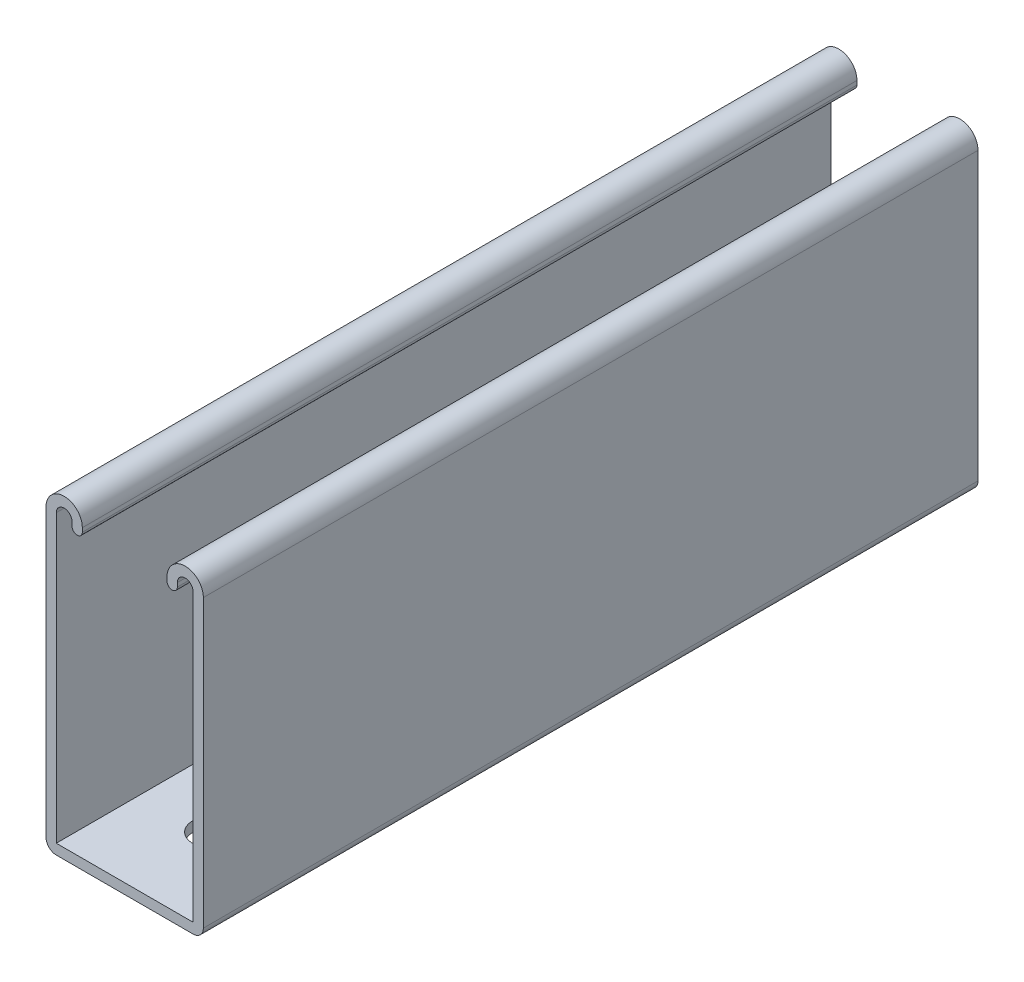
ISO-10303-21;
HEADER;
FILE_DESCRIPTION(('STEP AP214'),'2;1');
FILE_NAME('part.step','',(''),(''),'','','');
FILE_SCHEMA(('AUTOMOTIVE_DESIGN { 1 0 10303 214 1 1 1 1 }'));
ENDSEC;
DATA;
#1=APPLICATION_CONTEXT('core data for automotive mechanical design processes');
#2=APPLICATION_PROTOCOL_DEFINITION('international standard','automotive_design',2000,#1);
#3=PRODUCT_CONTEXT('',#1,'mechanical');
#4=PRODUCT('Part','Part','',(#3));
#5=PRODUCT_RELATED_PRODUCT_CATEGORY('part','',(#4));
#6=PRODUCT_DEFINITION_FORMATION('','',#4);
#7=PRODUCT_DEFINITION_CONTEXT('part definition',#1,'design');
#8=PRODUCT_DEFINITION('design','',#6,#7);
#9=PRODUCT_DEFINITION_SHAPE('','',#8);
#10=(LENGTH_UNIT() NAMED_UNIT(*) SI_UNIT(.MILLI.,.METRE.));
#11=(NAMED_UNIT(*) PLANE_ANGLE_UNIT() SI_UNIT($,.RADIAN.));
#12=(NAMED_UNIT(*) SI_UNIT($,.STERADIAN.) SOLID_ANGLE_UNIT());
#13=UNCERTAINTY_MEASURE_WITH_UNIT(LENGTH_MEASURE(1.E-05),#10,'distance_accuracy_value','');
#14=(GEOMETRIC_REPRESENTATION_CONTEXT(3) GLOBAL_UNCERTAINTY_ASSIGNED_CONTEXT((#13)) GLOBAL_UNIT_ASSIGNED_CONTEXT((#10,
#11,#12)) REPRESENTATION_CONTEXT('',''));
#15=CARTESIAN_POINT('',(0.,0.,0.));
#16=DIRECTION('',(0.,0.,1.));
#17=DIRECTION('',(1.,0.,0.));
#18=AXIS2_PLACEMENT_3D('',#15,#16,#17);
#19=CARTESIAN_POINT('',(-15.875,39.6875,203.2));
#20=DIRECTION('',(0.,0.,-1.));
#21=DIRECTION('',(-1.,0.,0.));
#22=AXIS2_PLACEMENT_3D('',#19,#20,#21);
#23=CYLINDRICAL_SURFACE('',#22,4.7625);
#24=CARTESIAN_POINT('',(-15.875,39.6875,0.));
#25=DIRECTION('',(0.,0.,1.));
#26=DIRECTION('',(-1.,0.,0.));
#27=AXIS2_PLACEMENT_3D('',#24,#25,#26);
#28=CIRCLE('',#27,4.7625);
#29=CARTESIAN_POINT('',(-11.1125,39.6875,0.));
#30=VERTEX_POINT('',#29);
#31=CARTESIAN_POINT('',(-20.6375,39.6875,0.));
#32=VERTEX_POINT('',#31);
#33=EDGE_CURVE('E260',#30,#32,#28,.T.);
#34=ORIENTED_EDGE('',*,*,#33,.T.);
#35=DIRECTION('',(0.,0.,-1.));
#36=VECTOR('',#35,1.);
#37=CARTESIAN_POINT('',(-20.6375,39.6875,203.2));
#38=LINE('',#37,#36);
#39=CARTESIAN_POINT('',(-20.6375,39.6875,203.2));
#40=VERTEX_POINT('',#39);
#41=EDGE_CURVE('E391',#40,#32,#38,.T.);
#42=ORIENTED_EDGE('',*,*,#41,.F.);
#43=CARTESIAN_POINT('',(-15.875,39.6875,203.2));
#44=DIRECTION('',(0.,0.,1.));
#45=DIRECTION('',(-1.,0.,0.));
#46=AXIS2_PLACEMENT_3D('',#43,#44,#45);
#47=CIRCLE('',#46,4.7625);
#48=CARTESIAN_POINT('',(-11.1125,39.6875,203.2));
#49=VERTEX_POINT('',#48);
#50=EDGE_CURVE('E267',#49,#40,#47,.T.);
#51=ORIENTED_EDGE('',*,*,#50,.F.);
#52=DIRECTION('',(0.,0.,-1.));
#53=VECTOR('',#52,1.);
#54=CARTESIAN_POINT('',(-11.1125,39.6875,203.2));
#55=LINE('',#54,#53);
#56=EDGE_CURVE('E305',#49,#30,#55,.T.);
#57=ORIENTED_EDGE('',*,*,#56,.T.);
#58=EDGE_LOOP('',(#34,#42,#51,#57));
#59=FACE_BOUND('',#58,.T.);
#60=ADVANCED_FACE('F39',(#59),#23,.T.);
#61=CARTESIAN_POINT('',(-20.6375,39.6875,203.2));
#62=DIRECTION('',(1.,0.,0.));
#63=DIRECTION('',(0.,1.,0.));
#64=AXIS2_PLACEMENT_3D('',#61,#62,#63);
#65=PLANE('',#64);
#66=DIRECTION('',(0.,-1.,0.));
#67=VECTOR('',#66,1.);
#68=CARTESIAN_POINT('',(-20.6375,39.6875,0.));
#69=LINE('',#68,#67);
#70=CARTESIAN_POINT('',(-20.6375,-35.4076,0.));
#71=VERTEX_POINT('',#70);
#72=EDGE_CURVE('E308',#32,#71,#69,.T.);
#73=ORIENTED_EDGE('',*,*,#72,.T.);
#74=DIRECTION('',(0.,0.,-1.));
#75=VECTOR('',#74,1.);
#76=CARTESIAN_POINT('',(-20.6375,-35.4076,203.2));
#77=LINE('',#76,#75);
#78=CARTESIAN_POINT('',(-20.6375,-35.4076,203.2));
#79=VERTEX_POINT('',#78);
#80=EDGE_CURVE('E388',#79,#71,#77,.T.);
#81=ORIENTED_EDGE('',*,*,#80,.F.);
#82=DIRECTION('',(0.,-1.,0.));
#83=VECTOR('',#82,1.);
#84=CARTESIAN_POINT('',(-20.6375,39.6875,203.2));
#85=LINE('',#84,#83);
#86=EDGE_CURVE('E270',#40,#79,#85,.T.);
#87=ORIENTED_EDGE('',*,*,#86,.F.);
#88=ORIENTED_EDGE('',*,*,#41,.T.);
#89=EDGE_LOOP('',(#73,#81,#87,#88));
#90=FACE_BOUND('',#89,.T.);
#91=ADVANCED_FACE('F433',(#90),#65,.F.);
#92=CARTESIAN_POINT('',(-17.9451,-35.4076,203.2));
#93=DIRECTION('',(0.,0.,-1.));
#94=DIRECTION('',(-1.,0.,0.));
#95=AXIS2_PLACEMENT_3D('',#92,#93,#94);
#96=CYLINDRICAL_SURFACE('',#95,2.6924);
#97=CARTESIAN_POINT('',(-17.9451,-35.4076,0.));
#98=DIRECTION('',(0.,0.,1.));
#99=DIRECTION('',(-1.,0.,0.));
#100=AXIS2_PLACEMENT_3D('',#97,#98,#99);
#101=CIRCLE('',#100,2.6924);
#102=CARTESIAN_POINT('',(-17.9451,-38.1,0.));
#103=VERTEX_POINT('',#102);
#104=EDGE_CURVE('E310',#71,#103,#101,.T.);
#105=ORIENTED_EDGE('',*,*,#104,.T.);
#106=DIRECTION('',(0.,0.,-1.));
#107=VECTOR('',#106,1.);
#108=CARTESIAN_POINT('',(-17.9451,-38.1,203.2));
#109=LINE('',#108,#107);
#110=CARTESIAN_POINT('',(-17.9451,-38.1,203.2));
#111=VERTEX_POINT('',#110);
#112=EDGE_CURVE('E385',#111,#103,#109,.T.);
#113=ORIENTED_EDGE('',*,*,#112,.F.);
#114=CARTESIAN_POINT('',(-17.9451,-35.4076,203.2));
#115=DIRECTION('',(0.,0.,1.));
#116=DIRECTION('',(-1.,0.,0.));
#117=AXIS2_PLACEMENT_3D('',#114,#115,#116);
#118=CIRCLE('',#117,2.6924);
#119=EDGE_CURVE('E273',#79,#111,#118,.T.);
#120=ORIENTED_EDGE('',*,*,#119,.F.);
#121=ORIENTED_EDGE('',*,*,#80,.T.);
#122=EDGE_LOOP('',(#105,#113,#120,#121));
#123=FACE_BOUND('',#122,.T.);
#124=ADVANCED_FACE('F438',(#123),#96,.T.);
#125=CARTESIAN_POINT('',(-17.9451,-38.1,203.2));
#126=DIRECTION('',(0.,1.,0.));
#127=DIRECTION('',(-1.,0.,0.));
#128=AXIS2_PLACEMENT_3D('',#125,#126,#127);
#129=PLANE('',#128);
#130=DIRECTION('',(0.,0.,-1.));
#131=VECTOR('',#130,1.);
#132=CARTESIAN_POINT('',(-5.15937500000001,-38.0999999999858,114.3));
#133=LINE('',#132,#131);
#134=CARTESIAN_POINT('',(-5.15937500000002,-38.1,180.18125));
#135=VERTEX_POINT('',#134);
#136=CARTESIAN_POINT('',(-5.15937500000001,-38.0999999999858,114.3));
#137=VERTEX_POINT('',#136);
#138=EDGE_CURVE('E213',#135,#137,#133,.T.);
#139=ORIENTED_EDGE('',*,*,#138,.F.);
#140=CARTESIAN_POINT('',(0.,-38.0999999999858,180.18125));
#141=DIRECTION('',(0.,-1.,0.));
#142=DIRECTION('',(1.,0.,0.));
#143=AXIS2_PLACEMENT_3D('',#140,#141,#142);
#144=CIRCLE('',#143,5.159375);
#145=CARTESIAN_POINT('',(5.15937499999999,-38.0999999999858,180.18125));
#146=VERTEX_POINT('',#145);
#147=EDGE_CURVE('E53',#146,#135,#144,.T.);
#148=ORIENTED_EDGE('',*,*,#147,.F.);
#149=DIRECTION('',(0.,0.,1.));
#150=VECTOR('',#149,1.);
#151=CARTESIAN_POINT('',(5.15937499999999,-38.0999999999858,180.18125));
#152=LINE('',#151,#150);
#153=CARTESIAN_POINT('',(5.159375,-38.0999999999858,114.3));
#154=VERTEX_POINT('',#153);
#155=EDGE_CURVE('E229',#154,#146,#152,.T.);
#156=ORIENTED_EDGE('',*,*,#155,.F.);
#157=CARTESIAN_POINT('',(0.,-38.0999999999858,114.3));
#158=DIRECTION('',(0.,-1.,0.));
#159=DIRECTION('',(1.,0.,0.));
#160=AXIS2_PLACEMENT_3D('',#157,#158,#159);
#161=CIRCLE('',#160,5.159375);
#162=EDGE_CURVE('E223',#137,#154,#161,.T.);
#163=ORIENTED_EDGE('',*,*,#162,.F.);
#164=EDGE_LOOP('',(#139,#148,#156,#163));
#165=FACE_BOUND('',#164,.T.);
#166=DIRECTION('',(0.,0.,-1.));
#167=VECTOR('',#166,1.);
#168=CARTESIAN_POINT('',(-5.15937500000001,-38.0999999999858,12.7));
#169=LINE('',#168,#167);
#170=CARTESIAN_POINT('',(-5.15937500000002,-38.1,78.58125));
#171=VERTEX_POINT('',#170);
#172=CARTESIAN_POINT('',(-5.15937500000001,-38.0999999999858,12.7));
#173=VERTEX_POINT('',#172);
#174=EDGE_CURVE('E248',#171,#173,#169,.T.);
#175=ORIENTED_EDGE('',*,*,#174,.F.);
#176=CARTESIAN_POINT('',(0.,-38.0999999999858,78.58125));
#177=DIRECTION('',(0.,-1.,0.));
#178=DIRECTION('',(1.,0.,0.));
#179=AXIS2_PLACEMENT_3D('',#176,#177,#178);
#180=CIRCLE('',#179,5.159375);
#181=CARTESIAN_POINT('',(5.15937499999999,-38.0999999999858,78.58125));
#182=VERTEX_POINT('',#181);
#183=EDGE_CURVE('E246',#182,#171,#180,.T.);
#184=ORIENTED_EDGE('',*,*,#183,.F.);
#185=DIRECTION('',(0.,0.,1.));
#186=VECTOR('',#185,1.);
#187=CARTESIAN_POINT('',(5.15937499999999,-38.0999999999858,78.58125));
#188=LINE('',#187,#186);
#189=CARTESIAN_POINT('',(5.159375,-38.0999999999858,12.7));
#190=VERTEX_POINT('',#189);
#191=EDGE_CURVE('E254',#190,#182,#188,.T.);
#192=ORIENTED_EDGE('',*,*,#191,.F.);
#193=CARTESIAN_POINT('',(0.,-38.0999999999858,12.7));
#194=DIRECTION('',(0.,-1.,0.));
#195=DIRECTION('',(1.,0.,0.));
#196=AXIS2_PLACEMENT_3D('',#193,#194,#195);
#197=CIRCLE('',#196,5.159375);
#198=EDGE_CURVE('E251',#173,#190,#197,.T.);
#199=ORIENTED_EDGE('',*,*,#198,.F.);
#200=EDGE_LOOP('',(#175,#184,#192,#199));
#201=FACE_BOUND('',#200,.T.);
#202=DIRECTION('',(1.,0.,0.));
#203=VECTOR('',#202,1.);
#204=CARTESIAN_POINT('',(-17.9451,-38.1,0.));
#205=LINE('',#204,#203);
#206=CARTESIAN_POINT('',(17.9451,-38.1,0.));
#207=VERTEX_POINT('',#206);
#208=EDGE_CURVE('E312',#103,#207,#205,.T.);
#209=ORIENTED_EDGE('',*,*,#208,.T.);
#210=DIRECTION('',(0.,0.,-1.));
#211=VECTOR('',#210,1.);
#212=CARTESIAN_POINT('',(17.9451,-38.1,203.2));
#213=LINE('',#212,#211);
#214=CARTESIAN_POINT('',(17.9451,-38.1,203.2));
#215=VERTEX_POINT('',#214);
#216=EDGE_CURVE('E382',#215,#207,#213,.T.);
#217=ORIENTED_EDGE('',*,*,#216,.F.);
#218=DIRECTION('',(1.,0.,0.));
#219=VECTOR('',#218,1.);
#220=CARTESIAN_POINT('',(-17.9451,-38.1,203.2));
#221=LINE('',#220,#219);
#222=EDGE_CURVE('E275',#111,#215,#221,.T.);
#223=ORIENTED_EDGE('',*,*,#222,.F.);
#224=ORIENTED_EDGE('',*,*,#112,.T.);
#225=EDGE_LOOP('',(#209,#217,#223,#224));
#226=FACE_BOUND('',#225,.T.);
#227=ADVANCED_FACE('F227',(#165,#201,#226),#129,.F.);
#228=CARTESIAN_POINT('',(17.9451,-35.4076,203.2));
#229=DIRECTION('',(0.,0.,-1.));
#230=DIRECTION('',(-1.,0.,0.));
#231=AXIS2_PLACEMENT_3D('',#228,#229,#230);
#232=CYLINDRICAL_SURFACE('',#231,2.6924);
#233=CARTESIAN_POINT('',(17.9451,-35.4076,0.));
#234=DIRECTION('',(0.,0.,1.));
#235=DIRECTION('',(1.,0.,0.));
#236=AXIS2_PLACEMENT_3D('',#233,#234,#235);
#237=CIRCLE('',#236,2.6924);
#238=CARTESIAN_POINT('',(20.6375,-35.4076,0.));
#239=VERTEX_POINT('',#238);
#240=EDGE_CURVE('E314',#207,#239,#237,.T.);
#241=ORIENTED_EDGE('',*,*,#240,.T.);
#242=DIRECTION('',(0.,0.,-1.));
#243=VECTOR('',#242,1.);
#244=CARTESIAN_POINT('',(20.6375,-35.4076,203.2));
#245=LINE('',#244,#243);
#246=CARTESIAN_POINT('',(20.6375,-35.4076,203.2));
#247=VERTEX_POINT('',#246);
#248=EDGE_CURVE('E379',#247,#239,#245,.T.);
#249=ORIENTED_EDGE('',*,*,#248,.F.);
#250=CARTESIAN_POINT('',(17.9451,-35.4076,203.2));
#251=DIRECTION('',(0.,0.,1.));
#252=DIRECTION('',(1.,0.,0.));
#253=AXIS2_PLACEMENT_3D('',#250,#251,#252);
#254=CIRCLE('',#253,2.6924);
#255=EDGE_CURVE('E277',#215,#247,#254,.T.);
#256=ORIENTED_EDGE('',*,*,#255,.F.);
#257=ORIENTED_EDGE('',*,*,#216,.T.);
#258=EDGE_LOOP('',(#241,#249,#256,#257));
#259=FACE_BOUND('',#258,.T.);
#260=ADVANCED_FACE('F518',(#259),#232,.T.);
#261=CARTESIAN_POINT('',(20.6375,-35.4076,203.2));
#262=DIRECTION('',(-1.,0.,0.));
#263=DIRECTION('',(0.,-1.,0.));
#264=AXIS2_PLACEMENT_3D('',#261,#262,#263);
#265=PLANE('',#264);
#266=DIRECTION('',(0.,1.,0.));
#267=VECTOR('',#266,1.);
#268=CARTESIAN_POINT('',(20.6375,-35.4076,0.));
#269=LINE('',#268,#267);
#270=CARTESIAN_POINT('',(20.6375,39.6875,0.));
#271=VERTEX_POINT('',#270);
#272=EDGE_CURVE('E316',#239,#271,#269,.T.);
#273=ORIENTED_EDGE('',*,*,#272,.T.);
#274=DIRECTION('',(0.,0.,-1.));
#275=VECTOR('',#274,1.);
#276=CARTESIAN_POINT('',(20.6375,39.6875,203.2));
#277=LINE('',#276,#275);
#278=CARTESIAN_POINT('',(20.6375,39.6875,203.2));
#279=VERTEX_POINT('',#278);
#280=EDGE_CURVE('E376',#279,#271,#277,.T.);
#281=ORIENTED_EDGE('',*,*,#280,.F.);
#282=DIRECTION('',(0.,1.,0.));
#283=VECTOR('',#282,1.);
#284=CARTESIAN_POINT('',(20.6375,-35.4076,203.2));
#285=LINE('',#284,#283);
#286=EDGE_CURVE('E279',#247,#279,#285,.T.);
#287=ORIENTED_EDGE('',*,*,#286,.F.);
#288=ORIENTED_EDGE('',*,*,#248,.T.);
#289=EDGE_LOOP('',(#273,#281,#287,#288));
#290=FACE_BOUND('',#289,.T.);
#291=ADVANCED_FACE('F514',(#290),#265,.F.);
#292=CARTESIAN_POINT('',(15.875,39.6875,203.2));
#293=DIRECTION('',(0.,0.,-1.));
#294=DIRECTION('',(-1.,0.,0.));
#295=AXIS2_PLACEMENT_3D('',#292,#293,#294);
#296=CYLINDRICAL_SURFACE('',#295,4.7625);
#297=CARTESIAN_POINT('',(15.875,39.6875,0.));
#298=DIRECTION('',(0.,0.,1.));
#299=DIRECTION('',(1.,0.,0.));
#300=AXIS2_PLACEMENT_3D('',#297,#298,#299);
#301=CIRCLE('',#300,4.7625);
#302=CARTESIAN_POINT('',(11.1125,39.6875,0.));
#303=VERTEX_POINT('',#302);
#304=EDGE_CURVE('E318',#271,#303,#301,.T.);
#305=ORIENTED_EDGE('',*,*,#304,.T.);
#306=DIRECTION('',(0.,0.,-1.));
#307=VECTOR('',#306,1.);
#308=CARTESIAN_POINT('',(11.1125,39.6875,203.2));
#309=LINE('',#308,#307);
#310=CARTESIAN_POINT('',(11.1125,39.6875,203.2));
#311=VERTEX_POINT('',#310);
#312=EDGE_CURVE('E373',#311,#303,#309,.T.);
#313=ORIENTED_EDGE('',*,*,#312,.F.);
#314=CARTESIAN_POINT('',(15.875,39.6875,203.2));
#315=DIRECTION('',(0.,0.,1.));
#316=DIRECTION('',(1.,0.,0.));
#317=AXIS2_PLACEMENT_3D('',#314,#315,#316);
#318=CIRCLE('',#317,4.7625);
#319=EDGE_CURVE('E281',#279,#311,#318,.T.);
#320=ORIENTED_EDGE('',*,*,#319,.F.);
#321=ORIENTED_EDGE('',*,*,#280,.T.);
#322=EDGE_LOOP('',(#305,#313,#320,#321));
#323=FACE_BOUND('',#322,.T.);
#324=ADVANCED_FACE('F509',(#323),#296,.T.);
#325=CARTESIAN_POINT('',(11.1125,39.6875,203.2));
#326=DIRECTION('',(1.,0.,0.));
#327=DIRECTION('',(0.,1.,0.));
#328=AXIS2_PLACEMENT_3D('',#325,#326,#327);
#329=PLANE('',#328);
#330=DIRECTION('',(0.,-1.,0.));
#331=VECTOR('',#330,1.);
#332=CARTESIAN_POINT('',(11.1125,39.6875,0.));
#333=LINE('',#332,#331);
#334=CARTESIAN_POINT('',(11.1125,38.65245,0.));
#335=VERTEX_POINT('',#334);
#336=EDGE_CURVE('E320',#303,#335,#333,.T.);
#337=ORIENTED_EDGE('',*,*,#336,.T.);
#338=DIRECTION('',(0.,0.,-1.));
#339=VECTOR('',#338,1.);
#340=CARTESIAN_POINT('',(11.1125,38.65245,203.2));
#341=LINE('',#340,#339);
#342=CARTESIAN_POINT('',(11.1125,38.65245,203.2));
#343=VERTEX_POINT('',#342);
#344=EDGE_CURVE('E370',#343,#335,#341,.T.);
#345=ORIENTED_EDGE('',*,*,#344,.F.);
#346=DIRECTION('',(0.,-1.,0.));
#347=VECTOR('',#346,1.);
#348=CARTESIAN_POINT('',(11.1125,39.6875,203.2));
#349=LINE('',#348,#347);
#350=EDGE_CURVE('E283',#311,#343,#349,.T.);
#351=ORIENTED_EDGE('',*,*,#350,.F.);
#352=ORIENTED_EDGE('',*,*,#312,.T.);
#353=EDGE_LOOP('',(#337,#345,#351,#352));
#354=FACE_BOUND('',#353,.T.);
#355=ADVANCED_FACE('F503',(#354),#329,.F.);
#356=CARTESIAN_POINT('',(12.4587,38.65245,203.2));
#357=DIRECTION('',(0.,0.,-1.));
#358=DIRECTION('',(-1.,0.,0.));
#359=AXIS2_PLACEMENT_3D('',#356,#357,#358);
#360=CYLINDRICAL_SURFACE('',#359,1.3462);
#361=CARTESIAN_POINT('',(12.4587,38.65245,0.));
#362=DIRECTION('',(0.,0.,1.));
#363=DIRECTION('',(1.,0.,0.));
#364=AXIS2_PLACEMENT_3D('',#361,#362,#363);
#365=CIRCLE('',#364,1.3462);
#366=CARTESIAN_POINT('',(13.8049,38.65245,0.));
#367=VERTEX_POINT('',#366);
#368=EDGE_CURVE('E322',#335,#367,#365,.T.);
#369=ORIENTED_EDGE('',*,*,#368,.T.);
#370=DIRECTION('',(0.,0.,-1.));
#371=VECTOR('',#370,1.);
#372=CARTESIAN_POINT('',(13.8049,38.65245,203.2));
#373=LINE('',#372,#371);
#374=CARTESIAN_POINT('',(13.8049,38.65245,203.2));
#375=VERTEX_POINT('',#374);
#376=EDGE_CURVE('E367',#375,#367,#373,.T.);
#377=ORIENTED_EDGE('',*,*,#376,.F.);
#378=CARTESIAN_POINT('',(12.4587,38.65245,203.2));
#379=DIRECTION('',(0.,0.,1.));
#380=DIRECTION('',(1.,0.,0.));
#381=AXIS2_PLACEMENT_3D('',#378,#379,#380);
#382=CIRCLE('',#381,1.3462);
#383=EDGE_CURVE('E285',#343,#375,#382,.T.);
#384=ORIENTED_EDGE('',*,*,#383,.F.);
#385=ORIENTED_EDGE('',*,*,#344,.T.);
#386=EDGE_LOOP('',(#369,#377,#384,#385));
#387=FACE_BOUND('',#386,.T.);
#388=ADVANCED_FACE('F499',(#387),#360,.T.);
#389=CARTESIAN_POINT('',(13.8049,39.6875,203.2));
#390=DIRECTION('',(-1.,0.,0.));
#391=DIRECTION('',(0.,0.,1.));
#392=AXIS2_PLACEMENT_3D('',#389,#390,#391);
#393=PLANE('',#392);
#394=DIRECTION('',(0.,1.,0.));
#395=VECTOR('',#394,1.);
#396=CARTESIAN_POINT('',(13.8049,39.6875,0.));
#397=LINE('',#396,#395);
#398=CARTESIAN_POINT('',(13.8049,39.6875,0.));
#399=VERTEX_POINT('',#398);
#400=EDGE_CURVE('E324',#367,#399,#397,.T.);
#401=ORIENTED_EDGE('',*,*,#400,.T.);
#402=DIRECTION('',(0.,0.,-1.));
#403=VECTOR('',#402,1.);
#404=CARTESIAN_POINT('',(13.8049,39.6875,203.2));
#405=LINE('',#404,#403);
#406=CARTESIAN_POINT('',(13.8049,39.6875,203.2));
#407=VERTEX_POINT('',#406);
#408=EDGE_CURVE('E364',#407,#399,#405,.T.);
#409=ORIENTED_EDGE('',*,*,#408,.F.);
#410=DIRECTION('',(0.,1.,0.));
#411=VECTOR('',#410,1.);
#412=CARTESIAN_POINT('',(13.8049,39.6875,203.2));
#413=LINE('',#412,#411);
#414=EDGE_CURVE('E287',#375,#407,#413,.T.);
#415=ORIENTED_EDGE('',*,*,#414,.F.);
#416=ORIENTED_EDGE('',*,*,#376,.T.);
#417=EDGE_LOOP('',(#401,#409,#415,#416));
#418=FACE_BOUND('',#417,.T.);
#419=ADVANCED_FACE('F494',(#418),#393,.F.);
#420=CARTESIAN_POINT('',(15.875,39.6875,203.2));
#421=DIRECTION('',(0.,0.,-1.));
#422=DIRECTION('',(-1.,0.,0.));
#423=AXIS2_PLACEMENT_3D('',#420,#421,#422);
#424=CYLINDRICAL_SURFACE('',#423,2.07010000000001);
#425=CARTESIAN_POINT('',(15.875,39.6875,0.));
#426=DIRECTION('',(0.,0.,-1.));
#427=DIRECTION('',(1.,0.,0.));
#428=AXIS2_PLACEMENT_3D('',#425,#426,#427);
#429=CIRCLE('',#428,2.07010000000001);
#430=CARTESIAN_POINT('',(17.9451,39.6875,0.));
#431=VERTEX_POINT('',#430);
#432=EDGE_CURVE('E326',#399,#431,#429,.T.);
#433=ORIENTED_EDGE('',*,*,#432,.T.);
#434=DIRECTION('',(0.,0.,-1.));
#435=VECTOR('',#434,1.);
#436=CARTESIAN_POINT('',(17.9451,39.6875,203.2));
#437=LINE('',#436,#435);
#438=CARTESIAN_POINT('',(17.9451,39.6875,203.2));
#439=VERTEX_POINT('',#438);
#440=EDGE_CURVE('E361',#439,#431,#437,.T.);
#441=ORIENTED_EDGE('',*,*,#440,.F.);
#442=CARTESIAN_POINT('',(15.875,39.6875,203.2));
#443=DIRECTION('',(0.,0.,-1.));
#444=DIRECTION('',(1.,0.,0.));
#445=AXIS2_PLACEMENT_3D('',#442,#443,#444);
#446=CIRCLE('',#445,2.07010000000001);
#447=EDGE_CURVE('E289',#407,#439,#446,.T.);
#448=ORIENTED_EDGE('',*,*,#447,.F.);
#449=ORIENTED_EDGE('',*,*,#408,.T.);
#450=EDGE_LOOP('',(#433,#441,#448,#449));
#451=FACE_BOUND('',#450,.T.);
#452=ADVANCED_FACE('F488',(#451),#424,.F.);
#453=CARTESIAN_POINT('',(17.9451,-35.4076,203.2));
#454=DIRECTION('',(1.,0.,0.));
#455=DIRECTION('',(0.,0.,-1.));
#456=AXIS2_PLACEMENT_3D('',#453,#454,#455);
#457=PLANE('',#456);
#458=DIRECTION('',(0.,-1.,0.));
#459=VECTOR('',#458,1.);
#460=CARTESIAN_POINT('',(17.9451,-35.4076,0.));
#461=LINE('',#460,#459);
#462=CARTESIAN_POINT('',(17.9451,-35.4076,0.));
#463=VERTEX_POINT('',#462);
#464=EDGE_CURVE('E328',#431,#463,#461,.T.);
#465=ORIENTED_EDGE('',*,*,#464,.T.);
#466=DIRECTION('',(0.,0.,-1.));
#467=VECTOR('',#466,1.);
#468=CARTESIAN_POINT('',(17.9451,-35.4076,203.2));
#469=LINE('',#468,#467);
#470=CARTESIAN_POINT('',(17.9451,-35.4076,203.2));
#471=VERTEX_POINT('',#470);
#472=EDGE_CURVE('E358',#471,#463,#469,.T.);
#473=ORIENTED_EDGE('',*,*,#472,.F.);
#474=DIRECTION('',(0.,-1.,0.));
#475=VECTOR('',#474,1.);
#476=CARTESIAN_POINT('',(17.9451,-35.4076,203.2));
#477=LINE('',#476,#475);
#478=EDGE_CURVE('E291',#439,#471,#477,.T.);
#479=ORIENTED_EDGE('',*,*,#478,.F.);
#480=ORIENTED_EDGE('',*,*,#440,.T.);
#481=EDGE_LOOP('',(#465,#473,#479,#480));
#482=FACE_BOUND('',#481,.T.);
#483=ADVANCED_FACE('F484',(#482),#457,.F.);
#484=CARTESIAN_POINT('',(-17.9451,-35.4076,203.2));
#485=DIRECTION('',(0.,-1.,0.));
#486=DIRECTION('',(0.,0.,-1.));
#487=AXIS2_PLACEMENT_3D('',#484,#485,#486);
#488=PLANE('',#487);
#489=DIRECTION('',(0.,0.,1.));
#490=VECTOR('',#489,1.);
#491=CARTESIAN_POINT('',(5.15937499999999,-35.4076,304.8));
#492=LINE('',#491,#490);
#493=CARTESIAN_POINT('',(5.159375,-35.4076,114.3));
#494=VERTEX_POINT('',#493);
#495=CARTESIAN_POINT('',(5.15937499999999,-35.4076,180.18125));
#496=VERTEX_POINT('',#495);
#497=EDGE_CURVE('E239',#494,#496,#492,.T.);
#498=ORIENTED_EDGE('',*,*,#497,.T.);
#499=CARTESIAN_POINT('',(0.,-35.4076,180.18125));
#500=DIRECTION('',(0.,-1.,0.));
#501=DIRECTION('',(0.,0.,-1.));
#502=AXIS2_PLACEMENT_3D('',#499,#500,#501);
#503=CIRCLE('',#502,5.159375);
#504=CARTESIAN_POINT('',(-5.15937500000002,-35.4076,180.18125));
#505=VERTEX_POINT('',#504);
#506=EDGE_CURVE('E243',#496,#505,#503,.T.);
#507=ORIENTED_EDGE('',*,*,#506,.T.);
#508=DIRECTION('',(0.,0.,-1.));
#509=VECTOR('',#508,1.);
#510=CARTESIAN_POINT('',(-5.15937500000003,-35.4076,304.8));
#511=LINE('',#510,#509);
#512=CARTESIAN_POINT('',(-5.15937500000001,-35.4076,114.3));
#513=VERTEX_POINT('',#512);
#514=EDGE_CURVE('E220',#505,#513,#511,.T.);
#515=ORIENTED_EDGE('',*,*,#514,.T.);
#516=CARTESIAN_POINT('',(0.,-35.4076,114.3));
#517=DIRECTION('',(0.,-1.,0.));
#518=DIRECTION('',(0.,0.,-1.));
#519=AXIS2_PLACEMENT_3D('',#516,#517,#518);
#520=CIRCLE('',#519,5.159375);
#521=EDGE_CURVE('E61',#513,#494,#520,.T.);
#522=ORIENTED_EDGE('',*,*,#521,.T.);
#523=EDGE_LOOP('',(#498,#507,#515,#522));
#524=FACE_BOUND('',#523,.T.);
#525=DIRECTION('',(0.,0.,1.));
#526=VECTOR('',#525,1.);
#527=CARTESIAN_POINT('',(5.15937499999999,-35.4076,203.2));
#528=LINE('',#527,#526);
#529=CARTESIAN_POINT('',(5.159375,-35.4076,12.7));
#530=VERTEX_POINT('',#529);
#531=CARTESIAN_POINT('',(5.15937499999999,-35.4076,78.58125));
#532=VERTEX_POINT('',#531);
#533=EDGE_CURVE('E46',#530,#532,#528,.T.);
#534=ORIENTED_EDGE('',*,*,#533,.T.);
#535=CARTESIAN_POINT('',(0.,-35.4076,78.58125));
#536=DIRECTION('',(0.,-1.,0.));
#537=DIRECTION('',(0.,0.,-1.));
#538=AXIS2_PLACEMENT_3D('',#535,#536,#537);
#539=CIRCLE('',#538,5.159375);
#540=CARTESIAN_POINT('',(-5.15937500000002,-35.4076,78.58125));
#541=VERTEX_POINT('',#540);
#542=EDGE_CURVE('E11',#532,#541,#539,.T.);
#543=ORIENTED_EDGE('',*,*,#542,.T.);
#544=DIRECTION('',(0.,0.,-1.));
#545=VECTOR('',#544,1.);
#546=CARTESIAN_POINT('',(-5.15937500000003,-35.4076,203.2));
#547=LINE('',#546,#545);
#548=CARTESIAN_POINT('',(-5.15937500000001,-35.4076,12.7));
#549=VERTEX_POINT('',#548);
#550=EDGE_CURVE('E394',#541,#549,#547,.T.);
#551=ORIENTED_EDGE('',*,*,#550,.T.);
#552=CARTESIAN_POINT('',(0.,-35.4076,12.7));
#553=DIRECTION('',(0.,-1.,0.));
#554=DIRECTION('',(0.,0.,-1.));
#555=AXIS2_PLACEMENT_3D('',#552,#553,#554);
#556=CIRCLE('',#555,5.159375);
#557=EDGE_CURVE('E397',#549,#530,#556,.T.);
#558=ORIENTED_EDGE('',*,*,#557,.T.);
#559=EDGE_LOOP('',(#534,#543,#551,#558));
#560=FACE_BOUND('',#559,.T.);
#561=DIRECTION('',(-1.,0.,0.));
#562=VECTOR('',#561,1.);
#563=CARTESIAN_POINT('',(-17.9451,-35.4076,0.));
#564=LINE('',#563,#562);
#565=CARTESIAN_POINT('',(-17.9451,-35.4076,0.));
#566=VERTEX_POINT('',#565);
#567=EDGE_CURVE('E330',#463,#566,#564,.T.);
#568=ORIENTED_EDGE('',*,*,#567,.T.);
#569=DIRECTION('',(0.,0.,-1.));
#570=VECTOR('',#569,1.);
#571=CARTESIAN_POINT('',(-17.9451,-35.4076,203.2));
#572=LINE('',#571,#570);
#573=CARTESIAN_POINT('',(-17.9451,-35.4076,203.2));
#574=VERTEX_POINT('',#573);
#575=EDGE_CURVE('E355',#574,#566,#572,.T.);
#576=ORIENTED_EDGE('',*,*,#575,.F.);
#577=DIRECTION('',(-1.,0.,0.));
#578=VECTOR('',#577,1.);
#579=CARTESIAN_POINT('',(-17.9451,-35.4076,203.2));
#580=LINE('',#579,#578);
#581=EDGE_CURVE('E293',#471,#574,#580,.T.);
#582=ORIENTED_EDGE('',*,*,#581,.F.);
#583=ORIENTED_EDGE('',*,*,#472,.T.);
#584=EDGE_LOOP('',(#568,#576,#582,#583));
#585=FACE_BOUND('',#584,.T.);
#586=ADVANCED_FACE('F401',(#524,#560,#585),#488,.F.);
#587=CARTESIAN_POINT('',(-17.9451,39.6875,203.2));
#588=DIRECTION('',(-1.,0.,0.));
#589=DIRECTION('',(0.,-1.,0.));
#590=AXIS2_PLACEMENT_3D('',#587,#588,#589);
#591=PLANE('',#590);
#592=DIRECTION('',(0.,1.,0.));
#593=VECTOR('',#592,1.);
#594=CARTESIAN_POINT('',(-17.9451,39.6875,0.));
#595=LINE('',#594,#593);
#596=CARTESIAN_POINT('',(-17.9451,39.6875,0.));
#597=VERTEX_POINT('',#596);
#598=EDGE_CURVE('E332',#566,#597,#595,.T.);
#599=ORIENTED_EDGE('',*,*,#598,.T.);
#600=DIRECTION('',(0.,0.,-1.));
#601=VECTOR('',#600,1.);
#602=CARTESIAN_POINT('',(-17.9451,39.6875,203.2));
#603=LINE('',#602,#601);
#604=CARTESIAN_POINT('',(-17.9451,39.6875,203.2));
#605=VERTEX_POINT('',#604);
#606=EDGE_CURVE('E352',#605,#597,#603,.T.);
#607=ORIENTED_EDGE('',*,*,#606,.F.);
#608=DIRECTION('',(0.,1.,0.));
#609=VECTOR('',#608,1.);
#610=CARTESIAN_POINT('',(-17.9451,39.6875,203.2));
#611=LINE('',#610,#609);
#612=EDGE_CURVE('E295',#574,#605,#611,.T.);
#613=ORIENTED_EDGE('',*,*,#612,.F.);
#614=ORIENTED_EDGE('',*,*,#575,.T.);
#615=EDGE_LOOP('',(#599,#607,#613,#614));
#616=FACE_BOUND('',#615,.T.);
#617=ADVANCED_FACE('F475',(#616),#591,.F.);
#618=CARTESIAN_POINT('',(-15.875,39.6875,203.2));
#619=DIRECTION('',(0.,0.,-1.));
#620=DIRECTION('',(-1.,0.,0.));
#621=AXIS2_PLACEMENT_3D('',#618,#619,#620);
#622=CYLINDRICAL_SURFACE('',#621,2.0701);
#623=CARTESIAN_POINT('',(-15.875,39.6875,0.));
#624=DIRECTION('',(0.,0.,-1.));
#625=DIRECTION('',(-1.,0.,0.));
#626=AXIS2_PLACEMENT_3D('',#623,#624,#625);
#627=CIRCLE('',#626,2.0701);
#628=CARTESIAN_POINT('',(-13.8049,39.6875,0.));
#629=VERTEX_POINT('',#628);
#630=EDGE_CURVE('E334',#597,#629,#627,.T.);
#631=ORIENTED_EDGE('',*,*,#630,.T.);
#632=DIRECTION('',(0.,0.,-1.));
#633=VECTOR('',#632,1.);
#634=CARTESIAN_POINT('',(-13.8049,39.6875,203.2));
#635=LINE('',#634,#633);
#636=CARTESIAN_POINT('',(-13.8049,39.6875,203.2));
#637=VERTEX_POINT('',#636);
#638=EDGE_CURVE('E349',#637,#629,#635,.T.);
#639=ORIENTED_EDGE('',*,*,#638,.F.);
#640=CARTESIAN_POINT('',(-15.875,39.6875,203.2));
#641=DIRECTION('',(0.,0.,-1.));
#642=DIRECTION('',(-1.,0.,0.));
#643=AXIS2_PLACEMENT_3D('',#640,#641,#642);
#644=CIRCLE('',#643,2.0701);
#645=EDGE_CURVE('E297',#605,#637,#644,.T.);
#646=ORIENTED_EDGE('',*,*,#645,.F.);
#647=ORIENTED_EDGE('',*,*,#606,.T.);
#648=EDGE_LOOP('',(#631,#639,#646,#647));
#649=FACE_BOUND('',#648,.T.);
#650=ADVANCED_FACE('F471',(#649),#622,.F.);
#651=CARTESIAN_POINT('',(-13.8049,39.6875,203.2));
#652=DIRECTION('',(1.,0.,0.));
#653=DIRECTION('',(0.,1.,0.));
#654=AXIS2_PLACEMENT_3D('',#651,#652,#653);
#655=PLANE('',#654);
#656=DIRECTION('',(0.,-1.,0.));
#657=VECTOR('',#656,1.);
#658=CARTESIAN_POINT('',(-13.8049,39.6875,0.));
#659=LINE('',#658,#657);
#660=CARTESIAN_POINT('',(-13.8049,38.65245,0.));
#661=VERTEX_POINT('',#660);
#662=EDGE_CURVE('E336',#629,#661,#659,.T.);
#663=ORIENTED_EDGE('',*,*,#662,.T.);
#664=DIRECTION('',(0.,0.,-1.));
#665=VECTOR('',#664,1.);
#666=CARTESIAN_POINT('',(-13.8049,38.65245,203.2));
#667=LINE('',#666,#665);
#668=CARTESIAN_POINT('',(-13.8049,38.65245,203.2));
#669=VERTEX_POINT('',#668);
#670=EDGE_CURVE('E346',#669,#661,#667,.T.);
#671=ORIENTED_EDGE('',*,*,#670,.F.);
#672=DIRECTION('',(0.,-1.,0.));
#673=VECTOR('',#672,1.);
#674=CARTESIAN_POINT('',(-13.8049,39.6875,203.2));
#675=LINE('',#674,#673);
#676=EDGE_CURVE('E299',#637,#669,#675,.T.);
#677=ORIENTED_EDGE('',*,*,#676,.F.);
#678=ORIENTED_EDGE('',*,*,#638,.T.);
#679=EDGE_LOOP('',(#663,#671,#677,#678));
#680=FACE_BOUND('',#679,.T.);
#681=ADVANCED_FACE('F466',(#680),#655,.F.);
#682=CARTESIAN_POINT('',(-12.4587,38.65245,203.2));
#683=DIRECTION('',(0.,0.,-1.));
#684=DIRECTION('',(-1.,0.,0.));
#685=AXIS2_PLACEMENT_3D('',#682,#683,#684);
#686=CYLINDRICAL_SURFACE('',#685,1.3462);
#687=CARTESIAN_POINT('',(-12.4587,38.65245,0.));
#688=DIRECTION('',(0.,0.,1.));
#689=DIRECTION('',(-1.,0.,0.));
#690=AXIS2_PLACEMENT_3D('',#687,#688,#689);
#691=CIRCLE('',#690,1.3462);
#692=CARTESIAN_POINT('',(-11.1125,38.65245,0.));
#693=VERTEX_POINT('',#692);
#694=EDGE_CURVE('E338',#661,#693,#691,.T.);
#695=ORIENTED_EDGE('',*,*,#694,.T.);
#696=DIRECTION('',(0.,0.,-1.));
#697=VECTOR('',#696,1.);
#698=CARTESIAN_POINT('',(-11.1125,38.65245,203.2));
#699=LINE('',#698,#697);
#700=CARTESIAN_POINT('',(-11.1125,38.65245,203.2));
#701=VERTEX_POINT('',#700);
#702=EDGE_CURVE('E343',#701,#693,#699,.T.);
#703=ORIENTED_EDGE('',*,*,#702,.F.);
#704=CARTESIAN_POINT('',(-12.4587,38.65245,203.2));
#705=DIRECTION('',(0.,0.,1.));
#706=DIRECTION('',(-1.,0.,0.));
#707=AXIS2_PLACEMENT_3D('',#704,#705,#706);
#708=CIRCLE('',#707,1.3462);
#709=EDGE_CURVE('E301',#669,#701,#708,.T.);
#710=ORIENTED_EDGE('',*,*,#709,.F.);
#711=ORIENTED_EDGE('',*,*,#670,.T.);
#712=EDGE_LOOP('',(#695,#703,#710,#711));
#713=FACE_BOUND('',#712,.T.);
#714=ADVANCED_FACE('F460',(#713),#686,.T.);
#715=CARTESIAN_POINT('',(-11.1125,39.6875,203.2));
#716=DIRECTION('',(-1.,0.,0.));
#717=DIRECTION('',(0.,-1.,0.));
#718=AXIS2_PLACEMENT_3D('',#715,#716,#717);
#719=PLANE('',#718);
#720=DIRECTION('',(0.,1.,0.));
#721=VECTOR('',#720,1.);
#722=CARTESIAN_POINT('',(-11.1125,39.6875,0.));
#723=LINE('',#722,#721);
#724=EDGE_CURVE('E271',#693,#30,#723,.T.);
#725=ORIENTED_EDGE('',*,*,#724,.T.);
#726=ORIENTED_EDGE('',*,*,#56,.F.);
#727=DIRECTION('',(0.,1.,0.));
#728=VECTOR('',#727,1.);
#729=CARTESIAN_POINT('',(-11.1125,39.6875,203.2));
#730=LINE('',#729,#728);
#731=EDGE_CURVE('E303',#701,#49,#730,.T.);
#732=ORIENTED_EDGE('',*,*,#731,.F.);
#733=ORIENTED_EDGE('',*,*,#702,.T.);
#734=EDGE_LOOP('',(#725,#726,#732,#733));
#735=FACE_BOUND('',#734,.T.);
#736=ADVANCED_FACE('F458',(#735),#719,.F.);
#737=CARTESIAN_POINT('',(-15.875,39.6875,203.2));
#738=DIRECTION('',(0.,0.,-1.));
#739=DIRECTION('',(-1.,0.,0.));
#740=AXIS2_PLACEMENT_3D('',#737,#738,#739);
#741=PLANE('',#740);
#742=ORIENTED_EDGE('',*,*,#50,.T.);
#743=ORIENTED_EDGE('',*,*,#86,.T.);
#744=ORIENTED_EDGE('',*,*,#119,.T.);
#745=ORIENTED_EDGE('',*,*,#222,.T.);
#746=ORIENTED_EDGE('',*,*,#255,.T.);
#747=ORIENTED_EDGE('',*,*,#286,.T.);
#748=ORIENTED_EDGE('',*,*,#319,.T.);
#749=ORIENTED_EDGE('',*,*,#350,.T.);
#750=ORIENTED_EDGE('',*,*,#383,.T.);
#751=ORIENTED_EDGE('',*,*,#414,.T.);
#752=ORIENTED_EDGE('',*,*,#447,.T.);
#753=ORIENTED_EDGE('',*,*,#478,.T.);
#754=ORIENTED_EDGE('',*,*,#581,.T.);
#755=ORIENTED_EDGE('',*,*,#612,.T.);
#756=ORIENTED_EDGE('',*,*,#645,.T.);
#757=ORIENTED_EDGE('',*,*,#676,.T.);
#758=ORIENTED_EDGE('',*,*,#709,.T.);
#759=ORIENTED_EDGE('',*,*,#731,.T.);
#760=EDGE_LOOP('',(#742,#743,#744,#745,#746,#747,#748,#749,#750,#751,#752,#753,#754,#755,#756,
#757,#758,#759));
#761=FACE_BOUND('',#760,.T.);
#762=ADVANCED_FACE('F453',(#761),#741,.F.);
#763=CARTESIAN_POINT('',(-15.875,39.6875,0.));
#764=DIRECTION('',(0.,0.,-1.));
#765=DIRECTION('',(-1.,0.,0.));
#766=AXIS2_PLACEMENT_3D('',#763,#764,#765);
#767=PLANE('',#766);
#768=ORIENTED_EDGE('',*,*,#33,.F.);
#769=ORIENTED_EDGE('',*,*,#724,.F.);
#770=ORIENTED_EDGE('',*,*,#694,.F.);
#771=ORIENTED_EDGE('',*,*,#662,.F.);
#772=ORIENTED_EDGE('',*,*,#630,.F.);
#773=ORIENTED_EDGE('',*,*,#598,.F.);
#774=ORIENTED_EDGE('',*,*,#567,.F.);
#775=ORIENTED_EDGE('',*,*,#464,.F.);
#776=ORIENTED_EDGE('',*,*,#432,.F.);
#777=ORIENTED_EDGE('',*,*,#400,.F.);
#778=ORIENTED_EDGE('',*,*,#368,.F.);
#779=ORIENTED_EDGE('',*,*,#336,.F.);
#780=ORIENTED_EDGE('',*,*,#304,.F.);
#781=ORIENTED_EDGE('',*,*,#272,.F.);
#782=ORIENTED_EDGE('',*,*,#240,.F.);
#783=ORIENTED_EDGE('',*,*,#208,.F.);
#784=ORIENTED_EDGE('',*,*,#104,.F.);
#785=ORIENTED_EDGE('',*,*,#72,.F.);
#786=EDGE_LOOP('',(#768,#769,#770,#771,#772,#773,#774,#775,#776,#777,#778,#779,#780,#781,#782,
#783,#784,#785));
#787=FACE_BOUND('',#786,.T.);
#788=ADVANCED_FACE('F446',(#787),#767,.T.);
#789=CARTESIAN_POINT('',(0.,44.45,78.58125));
#790=DIRECTION('',(0.,-1.,0.));
#791=DIRECTION('',(1.,0.,0.));
#792=AXIS2_PLACEMENT_3D('',#789,#790,#791);
#793=CYLINDRICAL_SURFACE('',#792,5.159375);
#794=DIRECTION('',(0.,-1.,0.));
#795=VECTOR('',#794,1.);
#796=CARTESIAN_POINT('',(5.15937500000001,44.45,78.58125));
#797=LINE('',#796,#795);
#798=EDGE_CURVE('E258',#532,#182,#797,.T.);
#799=ORIENTED_EDGE('',*,*,#798,.T.);
#800=ORIENTED_EDGE('',*,*,#183,.T.);
#801=DIRECTION('',(0.,-1.,0.));
#802=VECTOR('',#801,1.);
#803=CARTESIAN_POINT('',(-5.159375,44.45,78.58125));
#804=LINE('',#803,#802);
#805=EDGE_CURVE('E257',#541,#171,#804,.T.);
#806=ORIENTED_EDGE('',*,*,#805,.F.);
#807=ORIENTED_EDGE('',*,*,#542,.F.);
#808=EDGE_LOOP('',(#799,#800,#806,#807));
#809=FACE_BOUND('',#808,.T.);
#810=ADVANCED_FACE('F417',(#809),#793,.F.);
#811=CARTESIAN_POINT('',(5.15937500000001,44.45,78.58125));
#812=DIRECTION('',(1.,0.,0.));
#813=DIRECTION('',(0.,1.,0.));
#814=AXIS2_PLACEMENT_3D('',#811,#812,#813);
#815=PLANE('',#814);
#816=DIRECTION('',(0.,-1.,0.));
#817=VECTOR('',#816,1.);
#818=CARTESIAN_POINT('',(5.15937500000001,44.45,12.7));
#819=LINE('',#818,#817);
#820=EDGE_CURVE('E261',#530,#190,#819,.T.);
#821=ORIENTED_EDGE('',*,*,#820,.T.);
#822=ORIENTED_EDGE('',*,*,#191,.T.);
#823=ORIENTED_EDGE('',*,*,#798,.F.);
#824=ORIENTED_EDGE('',*,*,#533,.F.);
#825=EDGE_LOOP('',(#821,#822,#823,#824));
#826=FACE_BOUND('',#825,.T.);
#827=ADVANCED_FACE('F407',(#826),#815,.F.);
#828=CARTESIAN_POINT('',(0.,44.45,12.7));
#829=DIRECTION('',(0.,-1.,0.));
#830=DIRECTION('',(1.,0.,0.));
#831=AXIS2_PLACEMENT_3D('',#828,#829,#830);
#832=CYLINDRICAL_SURFACE('',#831,5.159375);
#833=DIRECTION('',(0.,-1.,0.));
#834=VECTOR('',#833,1.);
#835=CARTESIAN_POINT('',(-5.15937499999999,44.45,12.7));
#836=LINE('',#835,#834);
#837=EDGE_CURVE('E263',#549,#173,#836,.T.);
#838=ORIENTED_EDGE('',*,*,#837,.T.);
#839=ORIENTED_EDGE('',*,*,#198,.T.);
#840=ORIENTED_EDGE('',*,*,#820,.F.);
#841=ORIENTED_EDGE('',*,*,#557,.F.);
#842=EDGE_LOOP('',(#838,#839,#840,#841));
#843=FACE_BOUND('',#842,.T.);
#844=ADVANCED_FACE('F409',(#843),#832,.F.);
#845=CARTESIAN_POINT('',(-5.15937499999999,44.45,12.7));
#846=DIRECTION('',(-1.,0.,0.));
#847=DIRECTION('',(0.,-1.,0.));
#848=AXIS2_PLACEMENT_3D('',#845,#846,#847);
#849=PLANE('',#848);
#850=ORIENTED_EDGE('',*,*,#805,.T.);
#851=ORIENTED_EDGE('',*,*,#174,.T.);
#852=ORIENTED_EDGE('',*,*,#837,.F.);
#853=ORIENTED_EDGE('',*,*,#550,.F.);
#854=EDGE_LOOP('',(#850,#851,#852,#853));
#855=FACE_BOUND('',#854,.T.);
#856=ADVANCED_FACE('F419',(#855),#849,.F.);
#857=CARTESIAN_POINT('',(0.,44.45,180.18125));
#858=DIRECTION('',(0.,-1.,0.));
#859=DIRECTION('',(1.,0.,0.));
#860=AXIS2_PLACEMENT_3D('',#857,#858,#859);
#861=CYLINDRICAL_SURFACE('',#860,5.159375);
#862=DIRECTION('',(0.,-1.,0.));
#863=VECTOR('',#862,1.);
#864=CARTESIAN_POINT('',(5.15937500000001,44.45,180.18125));
#865=LINE('',#864,#863);
#866=EDGE_CURVE('E237',#496,#146,#865,.T.);
#867=ORIENTED_EDGE('',*,*,#866,.T.);
#868=ORIENTED_EDGE('',*,*,#147,.T.);
#869=DIRECTION('',(0.,-1.,0.));
#870=VECTOR('',#869,1.);
#871=CARTESIAN_POINT('',(-5.159375,44.45,180.18125));
#872=LINE('',#871,#870);
#873=EDGE_CURVE('E217',#505,#135,#872,.T.);
#874=ORIENTED_EDGE('',*,*,#873,.F.);
#875=ORIENTED_EDGE('',*,*,#506,.F.);
#876=EDGE_LOOP('',(#867,#868,#874,#875));
#877=FACE_BOUND('',#876,.T.);
#878=ADVANCED_FACE('F421',(#877),#861,.F.);
#879=CARTESIAN_POINT('',(5.15937500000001,44.45,180.18125));
#880=DIRECTION('',(1.,0.,0.));
#881=DIRECTION('',(0.,1.,0.));
#882=AXIS2_PLACEMENT_3D('',#879,#880,#881);
#883=PLANE('',#882);
#884=DIRECTION('',(0.,-1.,0.));
#885=VECTOR('',#884,1.);
#886=CARTESIAN_POINT('',(5.15937500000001,44.45,114.3));
#887=LINE('',#886,#885);
#888=EDGE_CURVE('E230',#494,#154,#887,.T.);
#889=ORIENTED_EDGE('',*,*,#888,.T.);
#890=ORIENTED_EDGE('',*,*,#155,.T.);
#891=ORIENTED_EDGE('',*,*,#866,.F.);
#892=ORIENTED_EDGE('',*,*,#497,.F.);
#893=EDGE_LOOP('',(#889,#890,#891,#892));
#894=FACE_BOUND('',#893,.T.);
#895=ADVANCED_FACE('F428',(#894),#883,.F.);
#896=CARTESIAN_POINT('',(0.,44.45,114.3));
#897=DIRECTION('',(0.,-1.,0.));
#898=DIRECTION('',(1.,0.,0.));
#899=AXIS2_PLACEMENT_3D('',#896,#897,#898);
#900=CYLINDRICAL_SURFACE('',#899,5.159375);
#901=DIRECTION('',(0.,-1.,0.));
#902=VECTOR('',#901,1.);
#903=CARTESIAN_POINT('',(-5.15937499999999,44.45,114.3));
#904=LINE('',#903,#902);
#905=EDGE_CURVE('E215',#513,#137,#904,.T.);
#906=ORIENTED_EDGE('',*,*,#905,.T.);
#907=ORIENTED_EDGE('',*,*,#162,.T.);
#908=ORIENTED_EDGE('',*,*,#888,.F.);
#909=ORIENTED_EDGE('',*,*,#521,.F.);
#910=EDGE_LOOP('',(#906,#907,#908,#909));
#911=FACE_BOUND('',#910,.T.);
#912=ADVANCED_FACE('F222',(#911),#900,.F.);
#913=CARTESIAN_POINT('',(-5.15937499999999,44.45,114.3));
#914=DIRECTION('',(-1.,0.,0.));
#915=DIRECTION('',(0.,-1.,0.));
#916=AXIS2_PLACEMENT_3D('',#913,#914,#915);
#917=PLANE('',#916);
#918=ORIENTED_EDGE('',*,*,#873,.T.);
#919=ORIENTED_EDGE('',*,*,#138,.T.);
#920=ORIENTED_EDGE('',*,*,#905,.F.);
#921=ORIENTED_EDGE('',*,*,#514,.F.);
#922=EDGE_LOOP('',(#918,#919,#920,#921));
#923=FACE_BOUND('',#922,.T.);
#924=ADVANCED_FACE('F214',(#923),#917,.F.);
#925=CLOSED_SHELL('',(#60,#91,#124,#227,#260,#291,#324,#355,#388,#419,#452,#483,#586,#617,#650,
#681,#714,#736,#762,#788,#810,#827,#844,#856,#878,#895,#912,#924));
#926=MANIFOLD_SOLID_BREP('B2',#925);
#927=ADVANCED_BREP_SHAPE_REPRESENTATION('',(#18,#926),#14);
#928=SHAPE_DEFINITION_REPRESENTATION(#9,#927);
ENDSEC;
END-ISO-10303-21;
